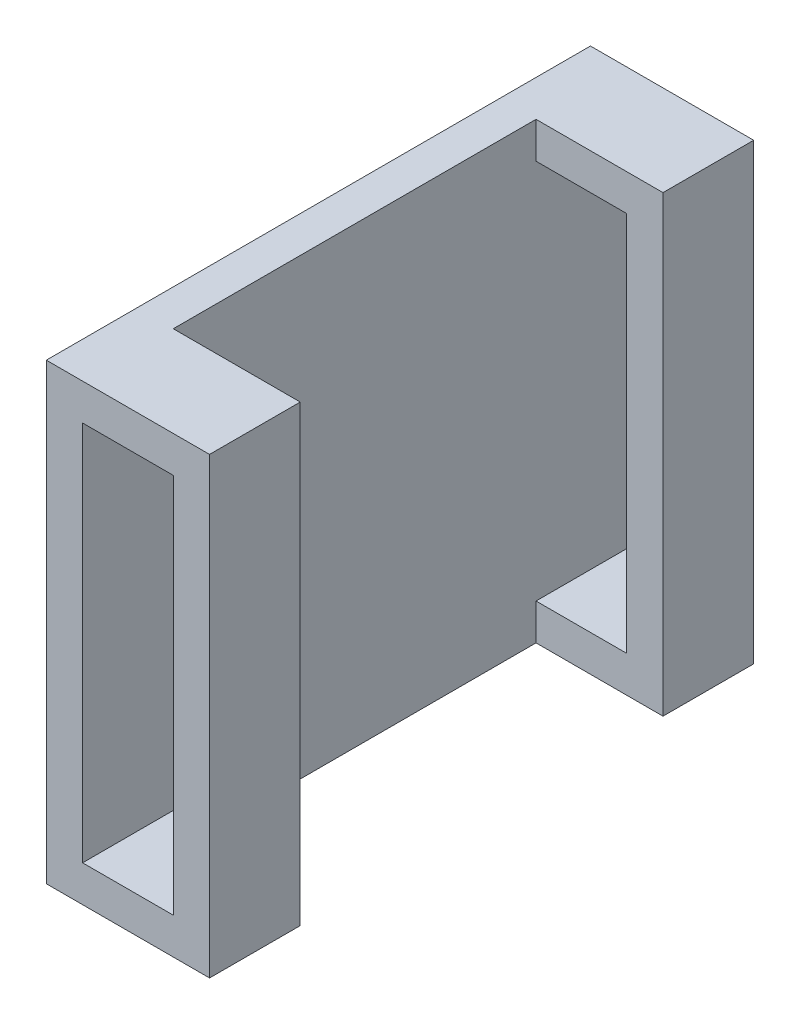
ISO-10303-21;
HEADER;
FILE_DESCRIPTION(('STEP AP214'),'2;1');
FILE_NAME('part.step','',(''),(''),'','','');
FILE_SCHEMA(('AUTOMOTIVE_DESIGN { 1 0 10303 214 1 1 1 1 }'));
ENDSEC;
DATA;
#1=APPLICATION_CONTEXT('core data for automotive mechanical design processes');
#2=APPLICATION_PROTOCOL_DEFINITION('international standard','automotive_design',2000,#1);
#3=PRODUCT_CONTEXT('',#1,'mechanical');
#4=PRODUCT('Part','Part','',(#3));
#5=PRODUCT_RELATED_PRODUCT_CATEGORY('part','',(#4));
#6=PRODUCT_DEFINITION_FORMATION('','',#4);
#7=PRODUCT_DEFINITION_CONTEXT('part definition',#1,'design');
#8=PRODUCT_DEFINITION('design','',#6,#7);
#9=PRODUCT_DEFINITION_SHAPE('','',#8);
#10=(LENGTH_UNIT() NAMED_UNIT(*) SI_UNIT(.MILLI.,.METRE.));
#11=(NAMED_UNIT(*) PLANE_ANGLE_UNIT() SI_UNIT($,.RADIAN.));
#12=(NAMED_UNIT(*) SI_UNIT($,.STERADIAN.) SOLID_ANGLE_UNIT());
#13=UNCERTAINTY_MEASURE_WITH_UNIT(LENGTH_MEASURE(1.E-05),#10,'distance_accuracy_value','');
#14=(GEOMETRIC_REPRESENTATION_CONTEXT(3) GLOBAL_UNCERTAINTY_ASSIGNED_CONTEXT((#13)) GLOBAL_UNIT_ASSIGNED_CONTEXT((#10,
#11,#12)) REPRESENTATION_CONTEXT('',''));
#15=CARTESIAN_POINT('',(0.,0.,0.));
#16=DIRECTION('',(0.,0.,1.));
#17=DIRECTION('',(1.,0.,0.));
#18=AXIS2_PLACEMENT_3D('',#15,#16,#17);
#19=CARTESIAN_POINT('',(2.,0.,0.));
#20=DIRECTION('',(-1.,0.,0.));
#21=DIRECTION('',(0.,0.,1.));
#22=AXIS2_PLACEMENT_3D('',#19,#20,#21);
#23=PLANE('',#22);
#24=DIRECTION('',(0.,-1.,0.));
#25=VECTOR('',#24,1.);
#26=CARTESIAN_POINT('',(2.,25.,-25.));
#27=LINE('',#26,#25);
#28=CARTESIAN_POINT('',(2.,2.,-25.));
#29=VERTEX_POINT('',#28);
#30=CARTESIAN_POINT('',(2.,0.,-25.));
#31=VERTEX_POINT('',#30);
#32=EDGE_CURVE('E223',#29,#31,#27,.T.);
#33=ORIENTED_EDGE('',*,*,#32,.F.);
#34=DIRECTION('',(0.,0.,-1.));
#35=VECTOR('',#34,1.);
#36=CARTESIAN_POINT('',(2.,2.,0.));
#37=LINE('',#36,#35);
#38=CARTESIAN_POINT('',(2.,2.,-30.));
#39=VERTEX_POINT('',#38);
#40=EDGE_CURVE('E177',#29,#39,#37,.T.);
#41=ORIENTED_EDGE('',*,*,#40,.T.);
#42=DIRECTION('',(0.,-1.,0.));
#43=VECTOR('',#42,1.);
#44=CARTESIAN_POINT('',(2.,23.,-30.));
#45=LINE('',#44,#43);
#46=CARTESIAN_POINT('',(2.,23.,-30.));
#47=VERTEX_POINT('',#46);
#48=EDGE_CURVE('E196',#47,#39,#45,.T.);
#49=ORIENTED_EDGE('',*,*,#48,.F.);
#50=DIRECTION('',(0.,0.,-1.));
#51=VECTOR('',#50,1.);
#52=CARTESIAN_POINT('',(2.,23.,0.));
#53=LINE('',#52,#51);
#54=CARTESIAN_POINT('',(2.,23.,-25.));
#55=VERTEX_POINT('',#54);
#56=EDGE_CURVE('E176',#55,#47,#53,.T.);
#57=ORIENTED_EDGE('',*,*,#56,.F.);
#58=CARTESIAN_POINT('',(2.,25.,-25.));
#59=VERTEX_POINT('',#58);
#60=EDGE_CURVE('E229',#59,#55,#27,.T.);
#61=ORIENTED_EDGE('',*,*,#60,.F.);
#62=DIRECTION('',(0.,0.,1.));
#63=VECTOR('',#62,1.);
#64=CARTESIAN_POINT('',(2.,25.,0.));
#65=LINE('',#64,#63);
#66=CARTESIAN_POINT('',(2.,25.,-5.));
#67=VERTEX_POINT('',#66);
#68=EDGE_CURVE('E283',#59,#67,#65,.T.);
#69=ORIENTED_EDGE('',*,*,#68,.T.);
#70=DIRECTION('',(0.,-1.,0.));
#71=VECTOR('',#70,1.);
#72=CARTESIAN_POINT('',(2.,25.,-5.));
#73=LINE('',#72,#71);
#74=CARTESIAN_POINT('',(2.,23.,-5.));
#75=VERTEX_POINT('',#74);
#76=EDGE_CURVE('E256',#67,#75,#73,.T.);
#77=ORIENTED_EDGE('',*,*,#76,.T.);
#78=CARTESIAN_POINT('',(2.,23.,0.));
#79=VERTEX_POINT('',#78);
#80=EDGE_CURVE('E59',#79,#75,#53,.T.);
#81=ORIENTED_EDGE('',*,*,#80,.F.);
#82=DIRECTION('',(0.,-1.,0.));
#83=VECTOR('',#82,1.);
#84=CARTESIAN_POINT('',(2.,23.,0.));
#85=LINE('',#84,#83);
#86=CARTESIAN_POINT('',(2.,2.,0.));
#87=VERTEX_POINT('',#86);
#88=EDGE_CURVE('E155',#79,#87,#85,.T.);
#89=ORIENTED_EDGE('',*,*,#88,.T.);
#90=CARTESIAN_POINT('',(2.,2.,-5.));
#91=VERTEX_POINT('',#90);
#92=EDGE_CURVE('E158',#87,#91,#37,.T.);
#93=ORIENTED_EDGE('',*,*,#92,.T.);
#94=CARTESIAN_POINT('',(2.,0.,-5.));
#95=VERTEX_POINT('',#94);
#96=EDGE_CURVE('E251',#91,#95,#73,.T.);
#97=ORIENTED_EDGE('',*,*,#96,.T.);
#98=DIRECTION('',(0.,0.,-1.));
#99=VECTOR('',#98,1.);
#100=CARTESIAN_POINT('',(2.,0.,0.));
#101=LINE('',#100,#99);
#102=EDGE_CURVE('E279',#95,#31,#101,.T.);
#103=ORIENTED_EDGE('',*,*,#102,.T.);
#104=EDGE_LOOP('',(#33,#41,#49,#57,#61,#69,#77,#81,#89,#93,#97,#103));
#105=FACE_BOUND('',#104,.T.);
#106=ADVANCED_FACE('F43',(#105),#23,.F.);
#107=CARTESIAN_POINT('',(2.,0.,0.));
#108=DIRECTION('',(0.,0.,-1.));
#109=DIRECTION('',(-1.,0.,0.));
#110=AXIS2_PLACEMENT_3D('',#107,#108,#109);
#111=PLANE('',#110);
#112=DIRECTION('',(0.,-1.,0.));
#113=VECTOR('',#112,1.);
#114=CARTESIAN_POINT('',(7.,23.,0.));
#115=LINE('',#114,#113);
#116=CARTESIAN_POINT('',(7.,23.,0.));
#117=VERTEX_POINT('',#116);
#118=CARTESIAN_POINT('',(7.,2.,0.));
#119=VERTEX_POINT('',#118);
#120=EDGE_CURVE('E181',#117,#119,#115,.T.);
#121=ORIENTED_EDGE('',*,*,#120,.T.);
#122=DIRECTION('',(-1.,0.,0.));
#123=VECTOR('',#122,1.);
#124=CARTESIAN_POINT('',(7.,2.,0.));
#125=LINE('',#124,#123);
#126=EDGE_CURVE('E165',#119,#87,#125,.T.);
#127=ORIENTED_EDGE('',*,*,#126,.T.);
#128=ORIENTED_EDGE('',*,*,#88,.F.);
#129=DIRECTION('',(-1.,0.,0.));
#130=VECTOR('',#129,1.);
#131=CARTESIAN_POINT('',(7.,23.,0.));
#132=LINE('',#131,#130);
#133=EDGE_CURVE('E164',#117,#79,#132,.T.);
#134=ORIENTED_EDGE('',*,*,#133,.F.);
#135=EDGE_LOOP('',(#121,#127,#128,#134));
#136=FACE_BOUND('',#135,.T.);
#137=DIRECTION('',(0.,-1.,0.));
#138=VECTOR('',#137,1.);
#139=CARTESIAN_POINT('',(0.,0.,0.));
#140=LINE('',#139,#138);
#141=CARTESIAN_POINT('',(0.,25.,0.));
#142=VERTEX_POINT('',#141);
#143=CARTESIAN_POINT('',(0.,0.,0.));
#144=VERTEX_POINT('',#143);
#145=EDGE_CURVE('E278',#142,#144,#140,.T.);
#146=ORIENTED_EDGE('',*,*,#145,.T.);
#147=DIRECTION('',(-1.,0.,0.));
#148=VECTOR('',#147,1.);
#149=CARTESIAN_POINT('',(2.,0.,0.));
#150=LINE('',#149,#148);
#151=CARTESIAN_POINT('',(9.,0.,0.));
#152=VERTEX_POINT('',#151);
#153=EDGE_CURVE('E310',#152,#144,#150,.T.);
#154=ORIENTED_EDGE('',*,*,#153,.F.);
#155=DIRECTION('',(0.,-1.,0.));
#156=VECTOR('',#155,1.);
#157=CARTESIAN_POINT('',(9.,25.,0.));
#158=LINE('',#157,#156);
#159=CARTESIAN_POINT('',(9.,25.,0.));
#160=VERTEX_POINT('',#159);
#161=EDGE_CURVE('E264',#160,#152,#158,.T.);
#162=ORIENTED_EDGE('',*,*,#161,.F.);
#163=DIRECTION('',(-1.,0.,0.));
#164=VECTOR('',#163,1.);
#165=CARTESIAN_POINT('',(2.,25.,0.));
#166=LINE('',#165,#164);
#167=EDGE_CURVE('E287',#160,#142,#166,.T.);
#168=ORIENTED_EDGE('',*,*,#167,.T.);
#169=EDGE_LOOP('',(#146,#154,#162,#168));
#170=FACE_BOUND('',#169,.T.);
#171=ADVANCED_FACE('F45',(#136,#170),#111,.F.);
#172=CARTESIAN_POINT('',(2.,0.,0.));
#173=DIRECTION('',(0.,1.,0.));
#174=DIRECTION('',(0.,0.,1.));
#175=AXIS2_PLACEMENT_3D('',#172,#173,#174);
#176=PLANE('',#175);
#177=DIRECTION('',(0.,0.,-1.));
#178=VECTOR('',#177,1.);
#179=CARTESIAN_POINT('',(0.,0.,0.));
#180=LINE('',#179,#178);
#181=CARTESIAN_POINT('',(0.,0.,-30.));
#182=VERTEX_POINT('',#181);
#183=EDGE_CURVE('E291',#144,#182,#180,.T.);
#184=ORIENTED_EDGE('',*,*,#183,.T.);
#185=DIRECTION('',(-1.,0.,0.));
#186=VECTOR('',#185,1.);
#187=CARTESIAN_POINT('',(2.,0.,-30.));
#188=LINE('',#187,#186);
#189=CARTESIAN_POINT('',(9.,0.,-30.));
#190=VERTEX_POINT('',#189);
#191=EDGE_CURVE('E306',#190,#182,#188,.T.);
#192=ORIENTED_EDGE('',*,*,#191,.F.);
#193=DIRECTION('',(0.,0.,-1.));
#194=VECTOR('',#193,1.);
#195=CARTESIAN_POINT('',(9.,0.,-25.));
#196=LINE('',#195,#194);
#197=CARTESIAN_POINT('',(9.,0.,-25.));
#198=VERTEX_POINT('',#197);
#199=EDGE_CURVE('E224',#198,#190,#196,.T.);
#200=ORIENTED_EDGE('',*,*,#199,.F.);
#201=DIRECTION('',(-1.,0.,0.));
#202=VECTOR('',#201,1.);
#203=CARTESIAN_POINT('',(9.,0.,-25.));
#204=LINE('',#203,#202);
#205=EDGE_CURVE('E240',#198,#31,#204,.T.);
#206=ORIENTED_EDGE('',*,*,#205,.T.);
#207=ORIENTED_EDGE('',*,*,#102,.F.);
#208=DIRECTION('',(-1.,0.,0.));
#209=VECTOR('',#208,1.);
#210=CARTESIAN_POINT('',(9.,0.,-5.));
#211=LINE('',#210,#209);
#212=CARTESIAN_POINT('',(9.,0.,-5.));
#213=VERTEX_POINT('',#212);
#214=EDGE_CURVE('E274',#213,#95,#211,.T.);
#215=ORIENTED_EDGE('',*,*,#214,.F.);
#216=DIRECTION('',(0.,0.,-1.));
#217=VECTOR('',#216,1.);
#218=CARTESIAN_POINT('',(9.,0.,0.));
#219=LINE('',#218,#217);
#220=EDGE_CURVE('E252',#152,#213,#219,.T.);
#221=ORIENTED_EDGE('',*,*,#220,.F.);
#222=ORIENTED_EDGE('',*,*,#153,.T.);
#223=EDGE_LOOP('',(#184,#192,#200,#206,#207,#215,#221,#222));
#224=FACE_BOUND('',#223,.T.);
#225=ADVANCED_FACE('F340',(#224),#176,.F.);
#226=CARTESIAN_POINT('',(2.,0.,-30.));
#227=DIRECTION('',(0.,0.,1.));
#228=DIRECTION('',(1.,0.,0.));
#229=AXIS2_PLACEMENT_3D('',#226,#227,#228);
#230=PLANE('',#229);
#231=ORIENTED_EDGE('',*,*,#48,.T.);
#232=DIRECTION('',(-1.,0.,0.));
#233=VECTOR('',#232,1.);
#234=CARTESIAN_POINT('',(7.,2.,-30.));
#235=LINE('',#234,#233);
#236=CARTESIAN_POINT('',(7.,2.,-30.));
#237=VERTEX_POINT('',#236);
#238=EDGE_CURVE('E67',#237,#39,#235,.T.);
#239=ORIENTED_EDGE('',*,*,#238,.F.);
#240=DIRECTION('',(0.,-1.,0.));
#241=VECTOR('',#240,1.);
#242=CARTESIAN_POINT('',(7.,23.,-30.));
#243=LINE('',#242,#241);
#244=CARTESIAN_POINT('',(7.,23.,-30.));
#245=VERTEX_POINT('',#244);
#246=EDGE_CURVE('E183',#245,#237,#243,.T.);
#247=ORIENTED_EDGE('',*,*,#246,.F.);
#248=DIRECTION('',(-1.,0.,0.));
#249=VECTOR('',#248,1.);
#250=CARTESIAN_POINT('',(7.,23.,-30.));
#251=LINE('',#250,#249);
#252=EDGE_CURVE('E187',#245,#47,#251,.T.);
#253=ORIENTED_EDGE('',*,*,#252,.T.);
#254=EDGE_LOOP('',(#231,#239,#247,#253));
#255=FACE_BOUND('',#254,.T.);
#256=DIRECTION('',(0.,1.,0.));
#257=VECTOR('',#256,1.);
#258=CARTESIAN_POINT('',(0.,0.,-30.));
#259=LINE('',#258,#257);
#260=CARTESIAN_POINT('',(0.,25.,-30.));
#261=VERTEX_POINT('',#260);
#262=EDGE_CURVE('E294',#182,#261,#259,.T.);
#263=ORIENTED_EDGE('',*,*,#262,.T.);
#264=DIRECTION('',(-1.,0.,0.));
#265=VECTOR('',#264,1.);
#266=CARTESIAN_POINT('',(2.,25.,-30.));
#267=LINE('',#266,#265);
#268=CARTESIAN_POINT('',(9.,25.,-30.));
#269=VERTEX_POINT('',#268);
#270=EDGE_CURVE('E302',#269,#261,#267,.T.);
#271=ORIENTED_EDGE('',*,*,#270,.F.);
#272=DIRECTION('',(0.,-1.,0.));
#273=VECTOR('',#272,1.);
#274=CARTESIAN_POINT('',(9.,25.,-30.));
#275=LINE('',#274,#273);
#276=EDGE_CURVE('E228',#269,#190,#275,.T.);
#277=ORIENTED_EDGE('',*,*,#276,.T.);
#278=ORIENTED_EDGE('',*,*,#191,.T.);
#279=EDGE_LOOP('',(#263,#271,#277,#278));
#280=FACE_BOUND('',#279,.T.);
#281=ADVANCED_FACE('F336',(#255,#280),#230,.F.);
#282=CARTESIAN_POINT('',(2.,25.,0.));
#283=DIRECTION('',(0.,-1.,0.));
#284=DIRECTION('',(0.,0.,-1.));
#285=AXIS2_PLACEMENT_3D('',#282,#283,#284);
#286=PLANE('',#285);
#287=DIRECTION('',(0.,0.,1.));
#288=VECTOR('',#287,1.);
#289=CARTESIAN_POINT('',(0.,25.,0.));
#290=LINE('',#289,#288);
#291=EDGE_CURVE('E284',#261,#142,#290,.T.);
#292=ORIENTED_EDGE('',*,*,#291,.T.);
#293=ORIENTED_EDGE('',*,*,#167,.F.);
#294=DIRECTION('',(0.,0.,-1.));
#295=VECTOR('',#294,1.);
#296=CARTESIAN_POINT('',(9.,25.,0.));
#297=LINE('',#296,#295);
#298=CARTESIAN_POINT('',(9.,25.,-5.));
#299=VERTEX_POINT('',#298);
#300=EDGE_CURVE('E260',#160,#299,#297,.T.);
#301=ORIENTED_EDGE('',*,*,#300,.T.);
#302=DIRECTION('',(-1.,0.,0.));
#303=VECTOR('',#302,1.);
#304=CARTESIAN_POINT('',(9.,25.,-5.));
#305=LINE('',#304,#303);
#306=EDGE_CURVE('E268',#299,#67,#305,.T.);
#307=ORIENTED_EDGE('',*,*,#306,.T.);
#308=ORIENTED_EDGE('',*,*,#68,.F.);
#309=DIRECTION('',(-1.,0.,0.));
#310=VECTOR('',#309,1.);
#311=CARTESIAN_POINT('',(9.,25.,-25.));
#312=LINE('',#311,#310);
#313=CARTESIAN_POINT('',(9.,25.,-25.));
#314=VERTEX_POINT('',#313);
#315=EDGE_CURVE('E247',#314,#59,#312,.T.);
#316=ORIENTED_EDGE('',*,*,#315,.F.);
#317=DIRECTION('',(0.,0.,-1.));
#318=VECTOR('',#317,1.);
#319=CARTESIAN_POINT('',(9.,25.,-25.));
#320=LINE('',#319,#318);
#321=EDGE_CURVE('E233',#314,#269,#320,.T.);
#322=ORIENTED_EDGE('',*,*,#321,.T.);
#323=ORIENTED_EDGE('',*,*,#270,.T.);
#324=EDGE_LOOP('',(#292,#293,#301,#307,#308,#316,#322,#323));
#325=FACE_BOUND('',#324,.T.);
#326=ADVANCED_FACE('F339',(#325),#286,.F.);
#327=CARTESIAN_POINT('',(0.,0.,0.));
#328=DIRECTION('',(-1.,0.,0.));
#329=DIRECTION('',(0.,0.,1.));
#330=AXIS2_PLACEMENT_3D('',#327,#328,#329);
#331=PLANE('',#330);
#332=ORIENTED_EDGE('',*,*,#145,.F.);
#333=ORIENTED_EDGE('',*,*,#291,.F.);
#334=ORIENTED_EDGE('',*,*,#262,.F.);
#335=ORIENTED_EDGE('',*,*,#183,.F.);
#336=EDGE_LOOP('',(#332,#333,#334,#335));
#337=FACE_BOUND('',#336,.T.);
#338=ADVANCED_FACE('F349',(#337),#331,.T.);
#339=CARTESIAN_POINT('',(9.,25.,-5.));
#340=DIRECTION('',(0.,0.,-1.));
#341=DIRECTION('',(0.,1.,0.));
#342=AXIS2_PLACEMENT_3D('',#339,#340,#341);
#343=PLANE('',#342);
#344=DIRECTION('',(-1.,0.,0.));
#345=VECTOR('',#344,1.);
#346=CARTESIAN_POINT('',(9.00000000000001,2.,-5.));
#347=LINE('',#346,#345);
#348=CARTESIAN_POINT('',(7.,2.,-5.));
#349=VERTEX_POINT('',#348);
#350=EDGE_CURVE('E173',#349,#91,#347,.T.);
#351=ORIENTED_EDGE('',*,*,#350,.F.);
#352=DIRECTION('',(0.,-1.,0.));
#353=VECTOR('',#352,1.);
#354=CARTESIAN_POINT('',(7.,25.,-5.));
#355=LINE('',#354,#353);
#356=CARTESIAN_POINT('',(7.,23.,-5.));
#357=VERTEX_POINT('',#356);
#358=EDGE_CURVE('E218',#357,#349,#355,.T.);
#359=ORIENTED_EDGE('',*,*,#358,.F.);
#360=DIRECTION('',(-1.,0.,0.));
#361=VECTOR('',#360,1.);
#362=CARTESIAN_POINT('',(9.,23.,-5.));
#363=LINE('',#362,#361);
#364=EDGE_CURVE('E206',#357,#75,#363,.T.);
#365=ORIENTED_EDGE('',*,*,#364,.T.);
#366=ORIENTED_EDGE('',*,*,#76,.F.);
#367=ORIENTED_EDGE('',*,*,#306,.F.);
#368=DIRECTION('',(0.,-1.,0.));
#369=VECTOR('',#368,1.);
#370=CARTESIAN_POINT('',(9.,25.,-5.));
#371=LINE('',#370,#369);
#372=EDGE_CURVE('E255',#299,#213,#371,.T.);
#373=ORIENTED_EDGE('',*,*,#372,.T.);
#374=ORIENTED_EDGE('',*,*,#214,.T.);
#375=ORIENTED_EDGE('',*,*,#96,.F.);
#376=EDGE_LOOP('',(#351,#359,#365,#366,#367,#373,#374,#375));
#377=FACE_BOUND('',#376,.T.);
#378=ADVANCED_FACE('F360',(#377),#343,.T.);
#379=CARTESIAN_POINT('',(9.,0.,0.));
#380=DIRECTION('',(-1.,0.,0.));
#381=DIRECTION('',(0.,0.,1.));
#382=AXIS2_PLACEMENT_3D('',#379,#380,#381);
#383=PLANE('',#382);
#384=ORIENTED_EDGE('',*,*,#220,.T.);
#385=ORIENTED_EDGE('',*,*,#372,.F.);
#386=ORIENTED_EDGE('',*,*,#300,.F.);
#387=ORIENTED_EDGE('',*,*,#161,.T.);
#388=EDGE_LOOP('',(#384,#385,#386,#387));
#389=FACE_BOUND('',#388,.T.);
#390=ADVANCED_FACE('F356',(#389),#383,.F.);
#391=CARTESIAN_POINT('',(9.,25.,-25.));
#392=DIRECTION('',(0.,0.,-1.));
#393=DIRECTION('',(0.,1.,0.));
#394=AXIS2_PLACEMENT_3D('',#391,#392,#393);
#395=PLANE('',#394);
#396=DIRECTION('',(0.,-1.,0.));
#397=VECTOR('',#396,1.);
#398=CARTESIAN_POINT('',(7.,25.,-25.));
#399=LINE('',#398,#397);
#400=CARTESIAN_POINT('',(7.,23.,-25.));
#401=VERTEX_POINT('',#400);
#402=CARTESIAN_POINT('',(7.,2.,-25.));
#403=VERTEX_POINT('',#402);
#404=EDGE_CURVE('E52',#401,#403,#399,.T.);
#405=ORIENTED_EDGE('',*,*,#404,.T.);
#406=DIRECTION('',(-1.,0.,0.));
#407=VECTOR('',#406,1.);
#408=CARTESIAN_POINT('',(9.00000000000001,2.,-25.));
#409=LINE('',#408,#407);
#410=EDGE_CURVE('E11',#403,#29,#409,.T.);
#411=ORIENTED_EDGE('',*,*,#410,.T.);
#412=ORIENTED_EDGE('',*,*,#32,.T.);
#413=ORIENTED_EDGE('',*,*,#205,.F.);
#414=DIRECTION('',(0.,-1.,0.));
#415=VECTOR('',#414,1.);
#416=CARTESIAN_POINT('',(9.,25.,-25.));
#417=LINE('',#416,#415);
#418=EDGE_CURVE('E237',#314,#198,#417,.T.);
#419=ORIENTED_EDGE('',*,*,#418,.F.);
#420=ORIENTED_EDGE('',*,*,#315,.T.);
#421=ORIENTED_EDGE('',*,*,#60,.T.);
#422=DIRECTION('',(-1.,0.,0.));
#423=VECTOR('',#422,1.);
#424=CARTESIAN_POINT('',(9.,23.,-25.));
#425=LINE('',#424,#423);
#426=EDGE_CURVE('E314',#401,#55,#425,.T.);
#427=ORIENTED_EDGE('',*,*,#426,.F.);
#428=EDGE_LOOP('',(#405,#411,#412,#413,#419,#420,#421,#427));
#429=FACE_BOUND('',#428,.T.);
#430=ADVANCED_FACE('F321',(#429),#395,.F.);
#431=CARTESIAN_POINT('',(9.,0.,0.));
#432=DIRECTION('',(-1.,0.,0.));
#433=DIRECTION('',(0.,0.,1.));
#434=AXIS2_PLACEMENT_3D('',#431,#432,#433);
#435=PLANE('',#434);
#436=ORIENTED_EDGE('',*,*,#199,.T.);
#437=ORIENTED_EDGE('',*,*,#276,.F.);
#438=ORIENTED_EDGE('',*,*,#321,.F.);
#439=ORIENTED_EDGE('',*,*,#418,.T.);
#440=EDGE_LOOP('',(#436,#437,#438,#439));
#441=FACE_BOUND('',#440,.T.);
#442=ADVANCED_FACE('F367',(#441),#435,.F.);
#443=CARTESIAN_POINT('',(7.,23.,0.));
#444=DIRECTION('',(0.,-1.,0.));
#445=DIRECTION('',(1.,0.,0.));
#446=AXIS2_PLACEMENT_3D('',#443,#444,#445);
#447=PLANE('',#446);
#448=ORIENTED_EDGE('',*,*,#426,.T.);
#449=ORIENTED_EDGE('',*,*,#56,.T.);
#450=ORIENTED_EDGE('',*,*,#252,.F.);
#451=DIRECTION('',(0.,0.,-1.));
#452=VECTOR('',#451,1.);
#453=CARTESIAN_POINT('',(7.,23.,0.));
#454=LINE('',#453,#452);
#455=EDGE_CURVE('E212',#401,#245,#454,.T.);
#456=ORIENTED_EDGE('',*,*,#455,.F.);
#457=EDGE_LOOP('',(#448,#449,#450,#456));
#458=FACE_BOUND('',#457,.T.);
#459=ADVANCED_FACE('F328',(#458),#447,.T.);
#460=CARTESIAN_POINT('',(7.,23.,0.));
#461=DIRECTION('',(1.,0.,0.));
#462=DIRECTION('',(0.,1.,0.));
#463=AXIS2_PLACEMENT_3D('',#460,#461,#462);
#464=PLANE('',#463);
#465=ORIENTED_EDGE('',*,*,#455,.T.);
#466=ORIENTED_EDGE('',*,*,#246,.T.);
#467=DIRECTION('',(0.,0.,-1.));
#468=VECTOR('',#467,1.);
#469=CARTESIAN_POINT('',(7.,2.,0.));
#470=LINE('',#469,#468);
#471=EDGE_CURVE('E207',#403,#237,#470,.T.);
#472=ORIENTED_EDGE('',*,*,#471,.F.);
#473=ORIENTED_EDGE('',*,*,#404,.F.);
#474=EDGE_LOOP('',(#465,#466,#472,#473));
#475=FACE_BOUND('',#474,.T.);
#476=ADVANCED_FACE('F325',(#475),#464,.F.);
#477=CARTESIAN_POINT('',(7.,2.,0.));
#478=DIRECTION('',(0.,-1.,0.));
#479=DIRECTION('',(1.,0.,0.));
#480=AXIS2_PLACEMENT_3D('',#477,#478,#479);
#481=PLANE('',#480);
#482=ORIENTED_EDGE('',*,*,#471,.T.);
#483=ORIENTED_EDGE('',*,*,#238,.T.);
#484=ORIENTED_EDGE('',*,*,#40,.F.);
#485=ORIENTED_EDGE('',*,*,#410,.F.);
#486=EDGE_LOOP('',(#482,#483,#484,#485));
#487=FACE_BOUND('',#486,.T.);
#488=ADVANCED_FACE('F371',(#487),#481,.F.);
#489=ORIENTED_EDGE('',*,*,#350,.T.);
#490=ORIENTED_EDGE('',*,*,#92,.F.);
#491=ORIENTED_EDGE('',*,*,#126,.F.);
#492=EDGE_CURVE('E203',#119,#349,#470,.T.);
#493=ORIENTED_EDGE('',*,*,#492,.T.);
#494=EDGE_LOOP('',(#489,#490,#491,#493));
#495=FACE_BOUND('',#494,.T.);
#496=ADVANCED_FACE('F169',(#495),#481,.F.);
#497=ORIENTED_EDGE('',*,*,#358,.T.);
#498=ORIENTED_EDGE('',*,*,#492,.F.);
#499=ORIENTED_EDGE('',*,*,#120,.F.);
#500=EDGE_CURVE('E208',#117,#357,#454,.T.);
#501=ORIENTED_EDGE('',*,*,#500,.T.);
#502=EDGE_LOOP('',(#497,#498,#499,#501));
#503=FACE_BOUND('',#502,.T.);
#504=ADVANCED_FACE('F378',(#503),#464,.F.);
#505=ORIENTED_EDGE('',*,*,#500,.F.);
#506=ORIENTED_EDGE('',*,*,#133,.T.);
#507=ORIENTED_EDGE('',*,*,#80,.T.);
#508=ORIENTED_EDGE('',*,*,#364,.F.);
#509=EDGE_LOOP('',(#505,#506,#507,#508));
#510=FACE_BOUND('',#509,.T.);
#511=ADVANCED_FACE('F436',(#510),#447,.T.);
#512=CLOSED_SHELL('',(#106,#171,#225,#281,#326,#338,#378,#390,#430,#442,#459,#476,#488,#496,
#504,#511));
#513=MANIFOLD_SOLID_BREP('B2',#512);
#514=ADVANCED_BREP_SHAPE_REPRESENTATION('',(#18,#513),#14);
#515=SHAPE_DEFINITION_REPRESENTATION(#9,#514);
ENDSEC;
END-ISO-10303-21;
